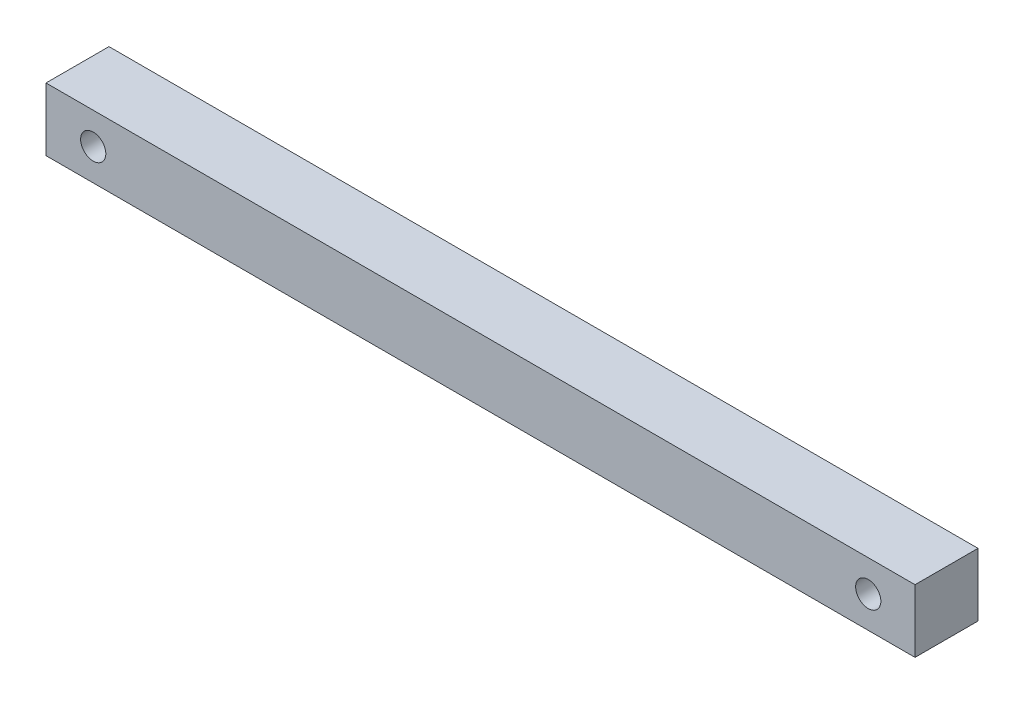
from build123d import *

# Parameters (mm, degrees)
SKETCH1_W           = 69
SKETCH1_H           = 5
BOSS_EXTRUDE1_DEPTH = 5
SKETCH2_R           = 1
CUT_EXTRUDE1_DEPTH  = 5


with BuildPart() as part:
    # Sketch1 → Boss-Extrude1 (new body)
    with BuildSketch(Plane.XY):
        with Locations((0.5, 0)):
            Rectangle(SKETCH1_W, SKETCH1_H)
    extrude(amount=BOSS_EXTRUDE1_DEPTH)

    # Sketch2 → Cut-Extrude1 (cut)
    with BuildSketch(Plane.XY.offset(5)):
        with Locations((-30.251209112, 0)):
            Circle(SKETCH2_R)
        with Locations((31.285030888, 0)):
            Circle(SKETCH2_R)
    extrude(amount=-CUT_EXTRUDE1_DEPTH, mode=Mode.SUBTRACT)


solid = part.part
